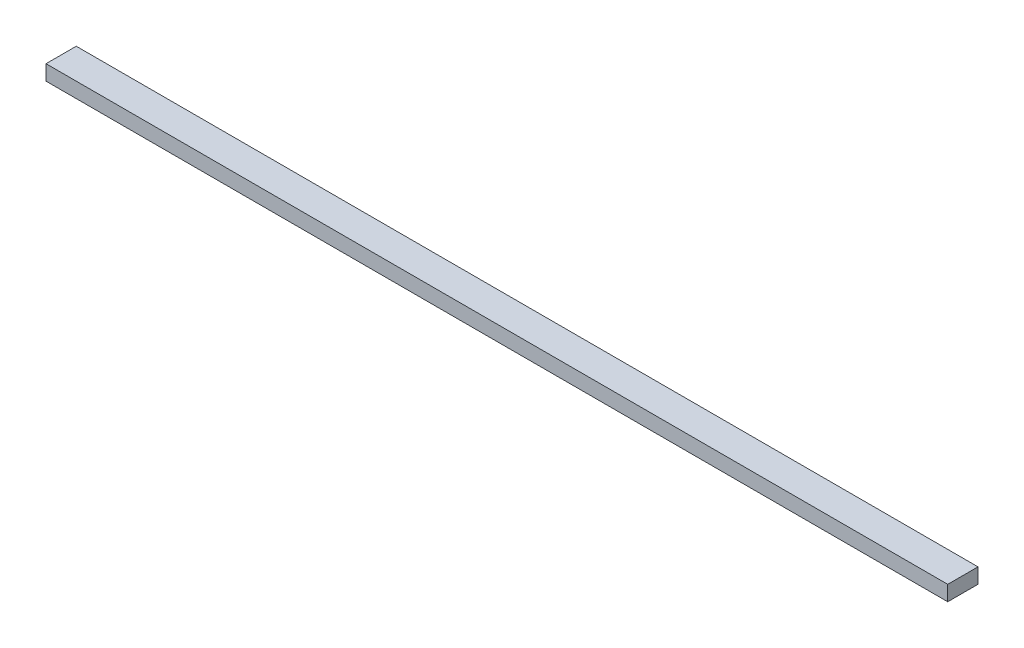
from build123d import *

# Parameters (mm, degrees)
ESQUISSE1_W      = 298
ESQUISSE1_H      = 10
EXTRUSION1_DEPTH = 5


with BuildPart() as part:
    # Esquisse1 → Extrusion1 (new body)
    with BuildSketch(Plane(origin=(0, 0, 0), x_dir=(1, 0, 0), z_dir=(0, 1, 0))):
        with Locations((149, 5)):
            Rectangle(ESQUISSE1_W, ESQUISSE1_H)
    extrude(amount=EXTRUSION1_DEPTH)


solid = part.part
